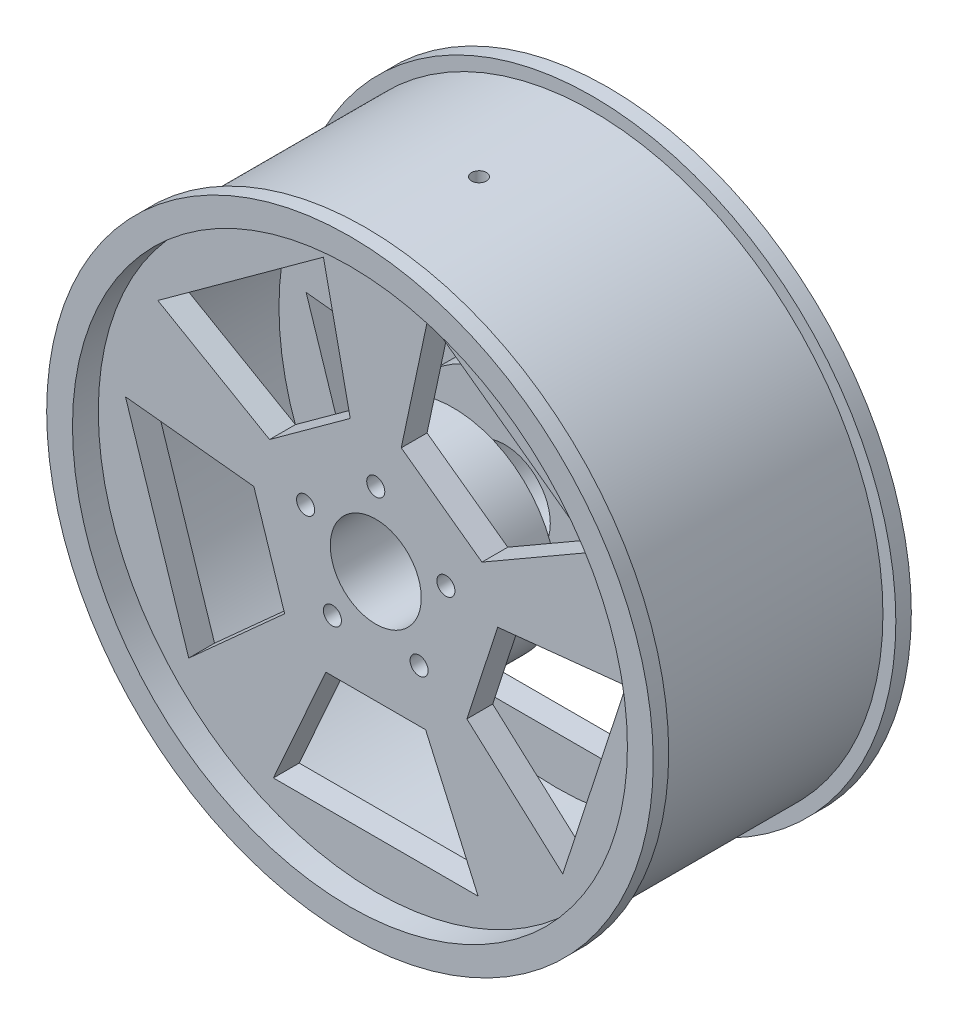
from build123d import *

# Parameters (mm, degrees)
F_02_WINDOW_1_DEPTH         = 378.955023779
F_02_WINDOW_2_DEPTH         = 378.955023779
F_02_WINDOW_3_DEPTH         = 378.955023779
F_02_WINDOW_4_DEPTH         = 378.955023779
F_02_WINDOW_5_DEPTH         = 378.955023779
SKETCH_7_R                  = 35.25
F_03_BORE_D70_5_DEPTH       = 378.955023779
SKETCH_8_R                  = 7
F_04_BOLT_HOLE_D14_1_DEPTH  = 378.955023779
SKETCH_9_R                  = 7
F_04_BOLT_HOLE_D14_2_DEPTH  = 378.955023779
SKETCH_10_R                 = 7
F_04_BOLT_HOLE_D14_3_DEPTH  = 378.955023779
SKETCH_11_R                 = 7
F_04_BOLT_HOLE_D14_4_DEPTH  = 378.955023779
SKETCH_12_R                 = 7
F_04_BOLT_HOLE_D14_5_DEPTH  = 378.955023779
SKETCH_13_R                 = 5.75
F_05_VALVE_HOLE_D11_5_DEPTH = 20


with BuildPart() as part:
    # Sketch 1 → 01_REVOLVE_WHEEL (revolve)
    with BuildSketch(Plane(origin=(0, 0, 0), x_dir=(0, 0, -1), z_dir=(1, 0, 0)), mode=Mode.PRIVATE) as f_01_revolve_wheel_sk:
        Polygon((0, 0), (0, 215), (-20, 215), (-20, 235), (-8, 235), (-8, 225), (168, 225), (168, 235), (180, 235), (180, 215), (160, 215), (160, 0), (100, 0), (100, 80), (140, 80), (140, 215), (20, 215), (20, 80), (60, 80), (60, 0), align=None)
    revolve(f_01_revolve_wheel_sk.sketch.rotate(Axis((0, 0, 40), (0, 0, -1)), 90), axis=Axis((0, 0, 40), (0, 0, -1)))

    # Sketch 2 → 02_WINDOW_1 (cut, through all)
    with BuildSketch(Plane.XY):
        Polygon((-19.751610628, 92.92402207), (-40.542779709, 190.738782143), (-168.874953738, 97.5), (-82.27241336, 47.5), align=None)
    extrude(amount=-F_02_WINDOW_1_DEPTH, mode=Mode.SUBTRACT)

    # Sketch 3 → 02_WINDOW_2 (cut, through all)
    with BuildSketch(Plane.XY):
        Polygon((-94.47958006, 9.93020401), (-193.931769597, 20.383050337), (-144.913240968, -130.48046824), (-70.59875842, -63.567407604), align=None)
    extrude(amount=-F_02_WINDOW_2_DEPTH, mode=Mode.SUBTRACT)

    # Sketch 4 → 02_WINDOW_3 (cut, through all)
    with BuildSketch(Plane.XY):
        Polygon((-38.639981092, -86.786818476), (-79.3136454, -178.14136424), (79.3136454, -178.14136424), (38.639981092, -86.786818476), align=None)
    extrude(amount=-F_02_WINDOW_3_DEPTH, mode=Mode.SUBTRACT)

    # Sketch 5 → 02_WINDOW_4 (cut, through all)
    with BuildSketch(Plane.XY):
        Polygon((70.59875842, -63.567407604), (144.913240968, -130.48046824), (193.931769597, 20.383050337), (94.47958006, 9.93020401), align=None)
    extrude(amount=-F_02_WINDOW_4_DEPTH, mode=Mode.SUBTRACT)

    # Sketch 6 → 02_WINDOW_5 (cut, through all)
    with BuildSketch(Plane.XY):
        Polygon((82.27241336, 47.5), (168.874953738, 97.5), (40.542779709, 190.738782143), (19.751610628, 92.92402207), align=None)
    extrude(amount=-F_02_WINDOW_5_DEPTH, mode=Mode.SUBTRACT)

    # Sketch 7 → 03_BORE_D70.5 (cut, through all)
    with BuildSketch(Plane.XY):
        Circle(SKETCH_7_R)
    extrude(amount=-F_03_BORE_D70_5_DEPTH, mode=Mode.SUBTRACT)

    # Sketch 8 → 04_BOLT_HOLE_D14_1 (cut, through all)
    with BuildSketch(Plane.XY):
        with Locations((0, 57.15)):
            Circle(SKETCH_8_R)
    extrude(amount=-F_04_BOLT_HOLE_D14_1_DEPTH, mode=Mode.SUBTRACT)

    # Sketch 9 → 04_BOLT_HOLE_D14_2 (cut, through all)
    with BuildSketch(Plane.XY):
        with Locations((-54.352879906, 17.660321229)):
            Circle(SKETCH_9_R)
    extrude(amount=-F_04_BOLT_HOLE_D14_2_DEPTH, mode=Mode.SUBTRACT)

    # Sketch 10 → 04_BOLT_HOLE_D14_3 (cut, through all)
    with BuildSketch(Plane.XY):
        with Locations((-33.591927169, -46.235321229)):
            Circle(SKETCH_10_R)
    extrude(amount=-F_04_BOLT_HOLE_D14_3_DEPTH, mode=Mode.SUBTRACT)

    # Sketch 11 → 04_BOLT_HOLE_D14_4 (cut, through all)
    with BuildSketch(Plane.XY):
        with Locations((33.591927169, -46.235321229)):
            Circle(SKETCH_11_R)
    extrude(amount=-F_04_BOLT_HOLE_D14_4_DEPTH, mode=Mode.SUBTRACT)

    # Sketch 12 → 04_BOLT_HOLE_D14_5 (cut, through all)
    with BuildSketch(Plane.XY):
        with Locations((54.352879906, 17.660321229)):
            Circle(SKETCH_12_R)
    extrude(amount=-F_04_BOLT_HOLE_D14_5_DEPTH, mode=Mode.SUBTRACT)

    # Sketch 13 → 05_VALVE_HOLE_D11.5 (cut)
    with BuildSketch(Plane(origin=(0, 225, 0), x_dir=(1, 0, 0), z_dir=(0, 1, 0))):
        with Locations(Location((0, 80, 0), (0, 0, 270))):
            Circle(SKETCH_13_R)
    extrude(amount=-F_05_VALVE_HOLE_D11_5_DEPTH, mode=Mode.SUBTRACT)


solid = part.part
